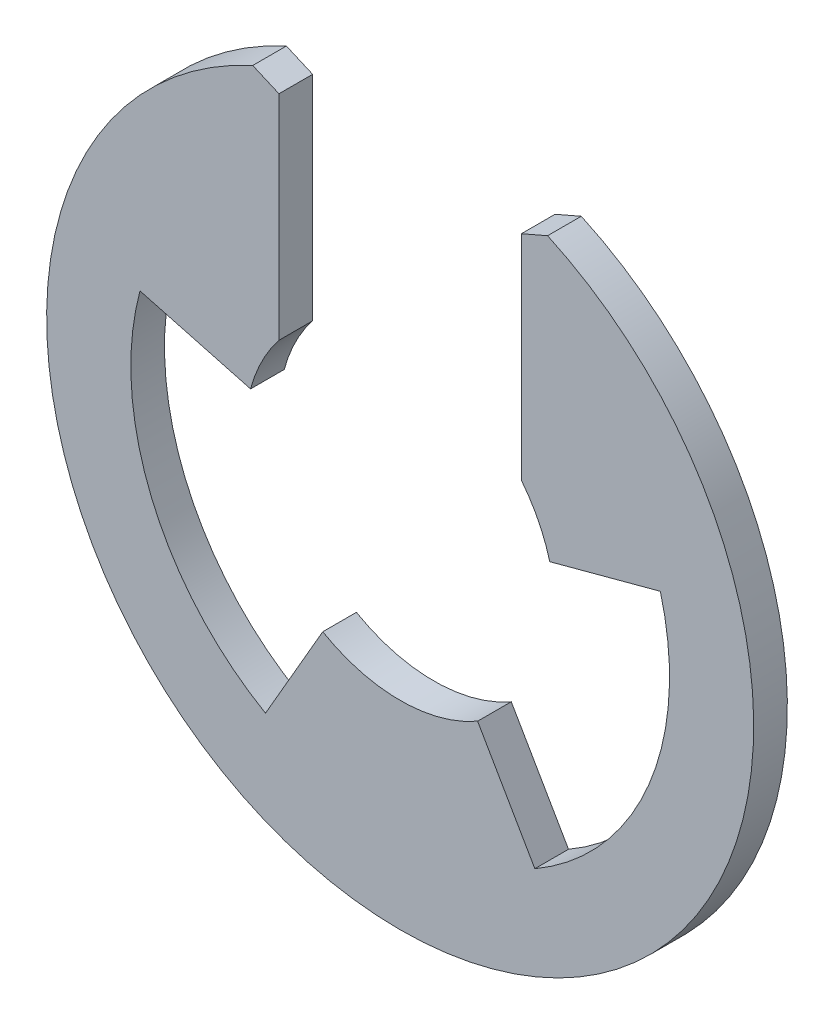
ISO-10303-21;
HEADER;
FILE_DESCRIPTION(('STEP AP214'),'2;1');
FILE_NAME('part.step','',(''),(''),'','','');
FILE_SCHEMA(('AUTOMOTIVE_DESIGN { 1 0 10303 214 1 1 1 1 }'));
ENDSEC;
DATA;
#1=APPLICATION_CONTEXT('core data for automotive mechanical design processes');
#2=APPLICATION_PROTOCOL_DEFINITION('international standard','automotive_design',2000,#1);
#3=PRODUCT_CONTEXT('',#1,'mechanical');
#4=PRODUCT('Part','Part','',(#3));
#5=PRODUCT_RELATED_PRODUCT_CATEGORY('part','',(#4));
#6=PRODUCT_DEFINITION_FORMATION('','',#4);
#7=PRODUCT_DEFINITION_CONTEXT('part definition',#1,'design');
#8=PRODUCT_DEFINITION('design','',#6,#7);
#9=PRODUCT_DEFINITION_SHAPE('','',#8);
#10=(LENGTH_UNIT() NAMED_UNIT(*) SI_UNIT(.MILLI.,.METRE.));
#11=(NAMED_UNIT(*) PLANE_ANGLE_UNIT() SI_UNIT($,.RADIAN.));
#12=(NAMED_UNIT(*) SI_UNIT($,.STERADIAN.) SOLID_ANGLE_UNIT());
#13=UNCERTAINTY_MEASURE_WITH_UNIT(LENGTH_MEASURE(1.E-05),#10,'distance_accuracy_value','');
#14=(GEOMETRIC_REPRESENTATION_CONTEXT(3) GLOBAL_UNCERTAINTY_ASSIGNED_CONTEXT((#13)) GLOBAL_UNIT_ASSIGNED_CONTEXT((#10,
#11,#12)) REPRESENTATION_CONTEXT('',''));
#15=CARTESIAN_POINT('',(0.,0.,0.));
#16=DIRECTION('',(0.,0.,1.));
#17=DIRECTION('',(1.,0.,0.));
#18=AXIS2_PLACEMENT_3D('',#15,#16,#17);
#19=CARTESIAN_POINT('',(0.,0.,0.635));
#20=DIRECTION('',(0.,0.,-1.));
#21=DIRECTION('',(-1.,0.,0.));
#22=AXIS2_PLACEMENT_3D('',#19,#20,#21);
#23=CYLINDRICAL_SURFACE('',#22,2.921);
#24=DIRECTION('',(0.,0.,1.));
#25=VECTOR('',#24,1.);
#26=CARTESIAN_POINT('',(-1.46049999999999,-2.52966020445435,0.));
#27=LINE('',#26,#25);
#28=CARTESIAN_POINT('',(-1.46049999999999,-2.52966020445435,0.));
#29=VERTEX_POINT('',#28);
#30=CARTESIAN_POINT('',(-1.46049999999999,-2.52966020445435,0.635));
#31=VERTEX_POINT('',#30);
#32=EDGE_CURVE('E193',#29,#31,#27,.T.);
#33=ORIENTED_EDGE('',*,*,#32,.T.);
#34=CARTESIAN_POINT('',(0.,0.,0.635));
#35=DIRECTION('',(0.,0.,1.));
#36=DIRECTION('',(1.,0.,0.));
#37=AXIS2_PLACEMENT_3D('',#34,#35,#36);
#38=CIRCLE('',#37,2.921);
#39=CARTESIAN_POINT('',(1.46049999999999,-2.52966020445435,0.635));
#40=VERTEX_POINT('',#39);
#41=EDGE_CURVE('E162',#31,#40,#38,.T.);
#42=ORIENTED_EDGE('',*,*,#41,.T.);
#43=DIRECTION('',(0.,0.,1.));
#44=VECTOR('',#43,1.);
#45=CARTESIAN_POINT('',(1.46049999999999,-2.52966020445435,0.));
#46=LINE('',#45,#44);
#47=CARTESIAN_POINT('',(1.46049999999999,-2.52966020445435,0.));
#48=VERTEX_POINT('',#47);
#49=EDGE_CURVE('E192',#48,#40,#46,.T.);
#50=ORIENTED_EDGE('',*,*,#49,.F.);
#51=CARTESIAN_POINT('',(0.,0.,0.));
#52=DIRECTION('',(0.,0.,1.));
#53=DIRECTION('',(1.,0.,0.));
#54=AXIS2_PLACEMENT_3D('',#51,#52,#53);
#55=CIRCLE('',#54,2.921);
#56=EDGE_CURVE('E159',#29,#48,#55,.T.);
#57=ORIENTED_EDGE('',*,*,#56,.F.);
#58=EDGE_LOOP('',(#33,#42,#50,#57));
#59=FACE_BOUND('',#58,.T.);
#60=ADVANCED_FACE('F33',(#59),#23,.F.);
#61=DIRECTION('',(0.,0.,1.));
#62=VECTOR('',#61,1.);
#63=CARTESIAN_POINT('',(-2.82146933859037,0.756010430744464,0.));
#64=LINE('',#63,#62);
#65=CARTESIAN_POINT('',(-2.82146933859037,0.756010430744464,0.));
#66=VERTEX_POINT('',#65);
#67=CARTESIAN_POINT('',(-2.82146933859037,0.756010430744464,0.635));
#68=VERTEX_POINT('',#67);
#69=EDGE_CURVE('E137',#66,#68,#64,.T.);
#70=ORIENTED_EDGE('',*,*,#69,.F.);
#71=CARTESIAN_POINT('',(-2.286,1.8183632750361,0.));
#72=VERTEX_POINT('',#71);
#73=EDGE_CURVE('E149',#72,#66,#55,.T.);
#74=ORIENTED_EDGE('',*,*,#73,.F.);
#75=DIRECTION('',(0.,0.,1.));
#76=VECTOR('',#75,1.);
#77=CARTESIAN_POINT('',(-2.286,1.8183632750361,0.));
#78=LINE('',#77,#76);
#79=CARTESIAN_POINT('',(-2.286,1.8183632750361,0.635));
#80=VERTEX_POINT('',#79);
#81=EDGE_CURVE('E171',#72,#80,#78,.T.);
#82=ORIENTED_EDGE('',*,*,#81,.T.);
#83=EDGE_CURVE('E151',#80,#68,#38,.T.);
#84=ORIENTED_EDGE('',*,*,#83,.T.);
#85=EDGE_LOOP('',(#70,#74,#82,#84));
#86=FACE_BOUND('',#85,.T.);
#87=ADVANCED_FACE('F147',(#86),#23,.F.);
#88=CARTESIAN_POINT('',(0.,0.,0.635));
#89=DIRECTION('',(0.,0.,1.));
#90=DIRECTION('',(1.,0.,0.));
#91=AXIS2_PLACEMENT_3D('',#88,#89,#90);
#92=PLANE('',#91);
#93=DIRECTION('',(0.499999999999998,0.86602540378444,0.));
#94=VECTOR('',#93,1.);
#95=CARTESIAN_POINT('',(-1.46049999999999,-2.52966020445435,0.635));
#96=LINE('',#95,#94);
#97=CARTESIAN_POINT('',(-2.53999999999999,-4.39940905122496,0.635));
#98=VERTEX_POINT('',#97);
#99=EDGE_CURVE('E142',#98,#31,#96,.T.);
#100=ORIENTED_EDGE('',*,*,#99,.F.);
#101=CARTESIAN_POINT('',(0.,0.,0.635));
#102=DIRECTION('',(0.,0.,1.));
#103=DIRECTION('',(1.,0.,0.));
#104=AXIS2_PLACEMENT_3D('',#101,#102,#103);
#105=CIRCLE('',#104,5.08);
#106=CARTESIAN_POINT('',(-4.90690319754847,1.31480074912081,0.635));
#107=VERTEX_POINT('',#106);
#108=EDGE_CURVE('E260',#107,#98,#105,.T.);
#109=ORIENTED_EDGE('',*,*,#108,.F.);
#110=DIRECTION('',(-0.965925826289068,0.258819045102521,0.));
#111=VECTOR('',#110,1.);
#112=CARTESIAN_POINT('',(-2.82146933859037,0.756010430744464,0.635));
#113=LINE('',#112,#111);
#114=EDGE_CURVE('E258',#68,#107,#113,.T.);
#115=ORIENTED_EDGE('',*,*,#114,.F.);
#116=ORIENTED_EDGE('',*,*,#83,.F.);
#117=DIRECTION('',(0.,-1.,0.));
#118=VECTOR('',#117,1.);
#119=CARTESIAN_POINT('',(-2.286,6.26336652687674,0.635));
#120=LINE('',#119,#118);
#121=CARTESIAN_POINT('',(-2.286,5.84515278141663,0.635));
#122=VERTEX_POINT('',#121);
#123=EDGE_CURVE('E219',#122,#80,#120,.T.);
#124=ORIENTED_EDGE('',*,*,#123,.F.);
#125=DIRECTION('',(-0.917278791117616,0.398245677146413,0.));
#126=VECTOR('',#125,1.);
#127=CARTESIAN_POINT('',(1.77268910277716,4.08303268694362,0.635));
#128=LINE('',#127,#126);
#129=CARTESIAN_POINT('',(-2.78074542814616,6.05995141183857,0.635));
#130=VERTEX_POINT('',#129);
#131=EDGE_CURVE('E240',#122,#130,#128,.T.);
#132=ORIENTED_EDGE('',*,*,#131,.T.);
#133=CARTESIAN_POINT('',(0.,0.,0.635));
#134=DIRECTION('',(0.,0.,1.));
#135=DIRECTION('',(1.,0.,0.));
#136=AXIS2_PLACEMENT_3D('',#133,#134,#135);
#137=CIRCLE('',#136,6.6675);
#138=CARTESIAN_POINT('',(2.78074542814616,6.05995141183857,0.635));
#139=VERTEX_POINT('',#138);
#140=EDGE_CURVE('E184',#130,#139,#137,.T.);
#141=ORIENTED_EDGE('',*,*,#140,.T.);
#142=DIRECTION('',(-0.917278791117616,-0.398245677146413,0.));
#143=VECTOR('',#142,1.);
#144=CARTESIAN_POINT('',(-1.77268910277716,4.08303268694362,0.635));
#145=LINE('',#144,#143);
#146=CARTESIAN_POINT('',(2.286,5.84515278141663,0.635));
#147=VERTEX_POINT('',#146);
#148=EDGE_CURVE('E235',#139,#147,#145,.T.);
#149=ORIENTED_EDGE('',*,*,#148,.T.);
#150=DIRECTION('',(0.,1.,0.));
#151=VECTOR('',#150,1.);
#152=CARTESIAN_POINT('',(2.286,1.8183632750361,0.635));
#153=LINE('',#152,#151);
#154=CARTESIAN_POINT('',(2.286,1.8183632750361,0.635));
#155=VERTEX_POINT('',#154);
#156=EDGE_CURVE('E180',#155,#147,#153,.T.);
#157=ORIENTED_EDGE('',*,*,#156,.F.);
#158=CARTESIAN_POINT('',(2.82146933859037,0.756010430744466,0.635));
#159=VERTEX_POINT('',#158);
#160=EDGE_CURVE('E158',#159,#155,#38,.T.);
#161=ORIENTED_EDGE('',*,*,#160,.F.);
#162=DIRECTION('',(-0.965925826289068,-0.258819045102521,0.));
#163=VECTOR('',#162,1.);
#164=CARTESIAN_POINT('',(4.90690319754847,1.31480074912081,0.635));
#165=LINE('',#164,#163);
#166=CARTESIAN_POINT('',(4.90690319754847,1.31480074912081,0.635));
#167=VERTEX_POINT('',#166);
#168=EDGE_CURVE('E56',#167,#159,#165,.T.);
#169=ORIENTED_EDGE('',*,*,#168,.F.);
#170=CARTESIAN_POINT('',(0.,0.,0.635));
#171=DIRECTION('',(0.,0.,1.));
#172=DIRECTION('',(1.,0.,0.));
#173=AXIS2_PLACEMENT_3D('',#170,#171,#172);
#174=CIRCLE('',#173,5.08);
#175=CARTESIAN_POINT('',(2.53999999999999,-4.39940905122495,0.635));
#176=VERTEX_POINT('',#175);
#177=EDGE_CURVE('E210',#176,#167,#174,.T.);
#178=ORIENTED_EDGE('',*,*,#177,.F.);
#179=DIRECTION('',(0.499999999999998,-0.86602540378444,0.));
#180=VECTOR('',#179,1.);
#181=CARTESIAN_POINT('',(1.46049999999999,-2.52966020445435,0.635));
#182=LINE('',#181,#180);
#183=EDGE_CURVE('E201',#40,#176,#182,.T.);
#184=ORIENTED_EDGE('',*,*,#183,.F.);
#185=ORIENTED_EDGE('',*,*,#41,.F.);
#186=EDGE_LOOP('',(#100,#109,#115,#116,#124,#132,#141,#149,#157,#161,#169,#178,#184,#185));
#187=FACE_BOUND('',#186,.T.);
#188=ADVANCED_FACE('F208',(#187),#92,.T.);
#189=CARTESIAN_POINT('',(0.,0.,0.));
#190=DIRECTION('',(0.,0.,1.));
#191=DIRECTION('',(1.,0.,0.));
#192=AXIS2_PLACEMENT_3D('',#189,#190,#191);
#193=PLANE('',#192);
#194=CARTESIAN_POINT('',(0.,0.,0.));
#195=DIRECTION('',(0.,0.,1.));
#196=DIRECTION('',(1.,0.,0.));
#197=AXIS2_PLACEMENT_3D('',#194,#195,#196);
#198=CIRCLE('',#197,5.08);
#199=CARTESIAN_POINT('',(-4.90690319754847,1.31480074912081,0.));
#200=VERTEX_POINT('',#199);
#201=CARTESIAN_POINT('',(-2.53999999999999,-4.39940905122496,0.));
#202=VERTEX_POINT('',#201);
#203=EDGE_CURVE('E48',#200,#202,#198,.T.);
#204=ORIENTED_EDGE('',*,*,#203,.T.);
#205=DIRECTION('',(0.499999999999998,0.86602540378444,0.));
#206=VECTOR('',#205,1.);
#207=CARTESIAN_POINT('',(-1.46049999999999,-2.52966020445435,0.));
#208=LINE('',#207,#206);
#209=EDGE_CURVE('E152',#202,#29,#208,.T.);
#210=ORIENTED_EDGE('',*,*,#209,.T.);
#211=ORIENTED_EDGE('',*,*,#56,.T.);
#212=DIRECTION('',(0.499999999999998,-0.86602540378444,0.));
#213=VECTOR('',#212,1.);
#214=CARTESIAN_POINT('',(1.46049999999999,-2.52966020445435,0.));
#215=LINE('',#214,#213);
#216=CARTESIAN_POINT('',(2.53999999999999,-4.39940905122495,0.));
#217=VERTEX_POINT('',#216);
#218=EDGE_CURVE('E204',#48,#217,#215,.T.);
#219=ORIENTED_EDGE('',*,*,#218,.T.);
#220=CARTESIAN_POINT('',(0.,0.,0.));
#221=DIRECTION('',(0.,0.,1.));
#222=DIRECTION('',(1.,0.,0.));
#223=AXIS2_PLACEMENT_3D('',#220,#221,#222);
#224=CIRCLE('',#223,5.08);
#225=CARTESIAN_POINT('',(4.90690319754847,1.31480074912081,0.));
#226=VERTEX_POINT('',#225);
#227=EDGE_CURVE('E211',#217,#226,#224,.T.);
#228=ORIENTED_EDGE('',*,*,#227,.T.);
#229=DIRECTION('',(-0.965925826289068,-0.258819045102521,0.));
#230=VECTOR('',#229,1.);
#231=CARTESIAN_POINT('',(4.90690319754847,1.31480074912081,0.));
#232=LINE('',#231,#230);
#233=CARTESIAN_POINT('',(2.82146933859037,0.756010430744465,0.));
#234=VERTEX_POINT('',#233);
#235=EDGE_CURVE('E214',#226,#234,#232,.T.);
#236=ORIENTED_EDGE('',*,*,#235,.T.);
#237=CARTESIAN_POINT('',(2.286,1.8183632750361,0.));
#238=VERTEX_POINT('',#237);
#239=EDGE_CURVE('E161',#234,#238,#55,.T.);
#240=ORIENTED_EDGE('',*,*,#239,.T.);
#241=DIRECTION('',(0.,1.,0.));
#242=VECTOR('',#241,1.);
#243=CARTESIAN_POINT('',(2.286,1.8183632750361,0.));
#244=LINE('',#243,#242);
#245=CARTESIAN_POINT('',(2.286,5.84515278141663,0.));
#246=VERTEX_POINT('',#245);
#247=EDGE_CURVE('E177',#238,#246,#244,.T.);
#248=ORIENTED_EDGE('',*,*,#247,.T.);
#249=DIRECTION('',(0.917278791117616,0.398245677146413,0.));
#250=VECTOR('',#249,1.);
#251=CARTESIAN_POINT('',(2.78074542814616,6.05995141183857,0.));
#252=LINE('',#251,#250);
#253=CARTESIAN_POINT('',(2.78074542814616,6.05995141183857,0.));
#254=VERTEX_POINT('',#253);
#255=EDGE_CURVE('E41',#246,#254,#252,.T.);
#256=ORIENTED_EDGE('',*,*,#255,.T.);
#257=CARTESIAN_POINT('',(0.,0.,0.));
#258=DIRECTION('',(0.,0.,1.));
#259=DIRECTION('',(1.,0.,0.));
#260=AXIS2_PLACEMENT_3D('',#257,#258,#259);
#261=CIRCLE('',#260,6.6675);
#262=CARTESIAN_POINT('',(-2.78074542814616,6.05995141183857,0.));
#263=VERTEX_POINT('',#262);
#264=EDGE_CURVE('E182',#263,#254,#261,.T.);
#265=ORIENTED_EDGE('',*,*,#264,.F.);
#266=DIRECTION('',(0.917278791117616,-0.398245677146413,0.));
#267=VECTOR('',#266,1.);
#268=CARTESIAN_POINT('',(-2.286,5.84515278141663,0.));
#269=LINE('',#268,#267);
#270=CARTESIAN_POINT('',(-2.286,5.84515278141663,0.));
#271=VERTEX_POINT('',#270);
#272=EDGE_CURVE('E237',#263,#271,#269,.T.);
#273=ORIENTED_EDGE('',*,*,#272,.T.);
#274=DIRECTION('',(0.,-1.,0.));
#275=VECTOR('',#274,1.);
#276=CARTESIAN_POINT('',(-2.286,6.26336652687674,0.));
#277=LINE('',#276,#275);
#278=EDGE_CURVE('E156',#271,#72,#277,.T.);
#279=ORIENTED_EDGE('',*,*,#278,.T.);
#280=ORIENTED_EDGE('',*,*,#73,.T.);
#281=DIRECTION('',(-0.965925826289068,0.258819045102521,0.));
#282=VECTOR('',#281,1.);
#283=CARTESIAN_POINT('',(-2.82146933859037,0.756010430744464,0.));
#284=LINE('',#283,#282);
#285=EDGE_CURVE('E133',#66,#200,#284,.T.);
#286=ORIENTED_EDGE('',*,*,#285,.T.);
#287=EDGE_LOOP('',(#204,#210,#211,#219,#228,#236,#240,#248,#256,#265,#273,#279,#280,#286));
#288=FACE_BOUND('',#287,.T.);
#289=ADVANCED_FACE('F154',(#288),#193,.F.);
#290=CARTESIAN_POINT('',(0.,0.,0.635));
#291=DIRECTION('',(0.,0.,-1.));
#292=DIRECTION('',(-1.,0.,0.));
#293=AXIS2_PLACEMENT_3D('',#290,#291,#292);
#294=CYLINDRICAL_SURFACE('',#293,6.6675);
#295=ORIENTED_EDGE('',*,*,#264,.T.);
#296=DIRECTION('',(0.,0.,-1.));
#297=VECTOR('',#296,1.);
#298=CARTESIAN_POINT('',(2.78074542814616,6.05995141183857,0.635));
#299=LINE('',#298,#297);
#300=EDGE_CURVE('E248',#254,#139,#299,.F.);
#301=ORIENTED_EDGE('',*,*,#300,.T.);
#302=ORIENTED_EDGE('',*,*,#140,.F.);
#303=DIRECTION('',(0.,0.,-1.));
#304=VECTOR('',#303,1.);
#305=CARTESIAN_POINT('',(-2.78074542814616,6.05995141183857,0.635));
#306=LINE('',#305,#304);
#307=EDGE_CURVE('E251',#130,#263,#306,.T.);
#308=ORIENTED_EDGE('',*,*,#307,.T.);
#309=EDGE_LOOP('',(#295,#301,#302,#308));
#310=FACE_BOUND('',#309,.T.);
#311=ADVANCED_FACE('F246',(#310),#294,.T.);
#312=DIRECTION('',(0.,0.,1.));
#313=VECTOR('',#312,1.);
#314=CARTESIAN_POINT('',(2.82146933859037,0.756010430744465,0.));
#315=LINE('',#314,#313);
#316=EDGE_CURVE('E206',#234,#159,#315,.T.);
#317=ORIENTED_EDGE('',*,*,#316,.T.);
#318=ORIENTED_EDGE('',*,*,#160,.T.);
#319=DIRECTION('',(0.,0.,1.));
#320=VECTOR('',#319,1.);
#321=CARTESIAN_POINT('',(2.286,1.8183632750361,0.));
#322=LINE('',#321,#320);
#323=EDGE_CURVE('E165',#238,#155,#322,.T.);
#324=ORIENTED_EDGE('',*,*,#323,.F.);
#325=ORIENTED_EDGE('',*,*,#239,.F.);
#326=EDGE_LOOP('',(#317,#318,#324,#325));
#327=FACE_BOUND('',#326,.T.);
#328=ADVANCED_FACE('F277',(#327),#23,.F.);
#329=CARTESIAN_POINT('',(-2.286,6.26336652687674,0.));
#330=DIRECTION('',(-1.,0.,0.));
#331=DIRECTION('',(0.,-1.,0.));
#332=AXIS2_PLACEMENT_3D('',#329,#330,#331);
#333=PLANE('',#332);
#334=ORIENTED_EDGE('',*,*,#278,.F.);
#335=DIRECTION('',(0.,0.,1.));
#336=VECTOR('',#335,1.);
#337=CARTESIAN_POINT('',(-2.286,5.84515278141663,0.));
#338=LINE('',#337,#336);
#339=EDGE_CURVE('E11',#271,#122,#338,.T.);
#340=ORIENTED_EDGE('',*,*,#339,.T.);
#341=ORIENTED_EDGE('',*,*,#123,.T.);
#342=ORIENTED_EDGE('',*,*,#81,.F.);
#343=EDGE_LOOP('',(#334,#340,#341,#342));
#344=FACE_BOUND('',#343,.T.);
#345=ADVANCED_FACE('F256',(#344),#333,.F.);
#346=CARTESIAN_POINT('',(2.286,1.8183632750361,0.));
#347=DIRECTION('',(1.,0.,0.));
#348=DIRECTION('',(0.,0.,-1.));
#349=AXIS2_PLACEMENT_3D('',#346,#347,#348);
#350=PLANE('',#349);
#351=ORIENTED_EDGE('',*,*,#156,.T.);
#352=DIRECTION('',(0.,0.,-1.));
#353=VECTOR('',#352,1.);
#354=CARTESIAN_POINT('',(2.286,5.84515278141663,0.));
#355=LINE('',#354,#353);
#356=EDGE_CURVE('E229',#147,#246,#355,.T.);
#357=ORIENTED_EDGE('',*,*,#356,.T.);
#358=ORIENTED_EDGE('',*,*,#247,.F.);
#359=ORIENTED_EDGE('',*,*,#323,.T.);
#360=EDGE_LOOP('',(#351,#357,#358,#359));
#361=FACE_BOUND('',#360,.T.);
#362=ADVANCED_FACE('F228',(#361),#350,.F.);
#363=CARTESIAN_POINT('',(2.78074542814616,6.05995141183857,0.635));
#364=DIRECTION('',(-0.398245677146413,0.917278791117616,0.));
#365=DIRECTION('',(-0.917278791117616,-0.398245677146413,0.));
#366=AXIS2_PLACEMENT_3D('',#363,#364,#365);
#367=PLANE('',#366);
#368=ORIENTED_EDGE('',*,*,#255,.F.);
#369=ORIENTED_EDGE('',*,*,#356,.F.);
#370=ORIENTED_EDGE('',*,*,#148,.F.);
#371=ORIENTED_EDGE('',*,*,#300,.F.);
#372=EDGE_LOOP('',(#368,#369,#370,#371));
#373=FACE_BOUND('',#372,.T.);
#374=ADVANCED_FACE('F233',(#373),#367,.T.);
#375=CARTESIAN_POINT('',(-2.286,5.84515278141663,0.635));
#376=DIRECTION('',(0.398245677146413,0.917278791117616,0.));
#377=DIRECTION('',(-0.917278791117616,0.398245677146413,0.));
#378=AXIS2_PLACEMENT_3D('',#375,#376,#377);
#379=PLANE('',#378);
#380=ORIENTED_EDGE('',*,*,#272,.F.);
#381=ORIENTED_EDGE('',*,*,#307,.F.);
#382=ORIENTED_EDGE('',*,*,#131,.F.);
#383=ORIENTED_EDGE('',*,*,#339,.F.);
#384=EDGE_LOOP('',(#380,#381,#382,#383));
#385=FACE_BOUND('',#384,.T.);
#386=ADVANCED_FACE('F35',(#385),#379,.T.);
#387=CARTESIAN_POINT('',(0.,0.,0.));
#388=DIRECTION('',(0.,0.,1.));
#389=DIRECTION('',(1.,0.,0.));
#390=AXIS2_PLACEMENT_3D('',#387,#388,#389);
#391=CYLINDRICAL_SURFACE('',#390,5.08);
#392=ORIENTED_EDGE('',*,*,#177,.T.);
#393=DIRECTION('',(0.,0.,1.));
#394=VECTOR('',#393,1.);
#395=CARTESIAN_POINT('',(4.90690319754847,1.31480074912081,0.));
#396=LINE('',#395,#394);
#397=EDGE_CURVE('E222',#226,#167,#396,.T.);
#398=ORIENTED_EDGE('',*,*,#397,.F.);
#399=ORIENTED_EDGE('',*,*,#227,.F.);
#400=DIRECTION('',(0.,0.,1.));
#401=VECTOR('',#400,1.);
#402=CARTESIAN_POINT('',(2.53999999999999,-4.39940905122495,0.));
#403=LINE('',#402,#401);
#404=EDGE_CURVE('E205',#217,#176,#403,.T.);
#405=ORIENTED_EDGE('',*,*,#404,.T.);
#406=EDGE_LOOP('',(#392,#398,#399,#405));
#407=FACE_BOUND('',#406,.T.);
#408=ADVANCED_FACE('F273',(#407),#391,.F.);
#409=CARTESIAN_POINT('',(1.46049999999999,-2.52966020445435,0.));
#410=DIRECTION('',(-0.86602540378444,-0.499999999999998,0.));
#411=DIRECTION('',(0.499999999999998,-0.86602540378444,0.));
#412=AXIS2_PLACEMENT_3D('',#409,#410,#411);
#413=PLANE('',#412);
#414=ORIENTED_EDGE('',*,*,#183,.T.);
#415=ORIENTED_EDGE('',*,*,#404,.F.);
#416=ORIENTED_EDGE('',*,*,#218,.F.);
#417=ORIENTED_EDGE('',*,*,#49,.T.);
#418=EDGE_LOOP('',(#414,#415,#416,#417));
#419=FACE_BOUND('',#418,.T.);
#420=ADVANCED_FACE('F200',(#419),#413,.F.);
#421=CARTESIAN_POINT('',(4.90690319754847,1.31480074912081,0.));
#422=DIRECTION('',(-0.258819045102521,0.965925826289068,0.));
#423=DIRECTION('',(-0.965925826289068,-0.258819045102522,0.));
#424=AXIS2_PLACEMENT_3D('',#421,#422,#423);
#425=PLANE('',#424);
#426=ORIENTED_EDGE('',*,*,#168,.T.);
#427=ORIENTED_EDGE('',*,*,#316,.F.);
#428=ORIENTED_EDGE('',*,*,#235,.F.);
#429=ORIENTED_EDGE('',*,*,#397,.T.);
#430=EDGE_LOOP('',(#426,#427,#428,#429));
#431=FACE_BOUND('',#430,.T.);
#432=ADVANCED_FACE('F278',(#431),#425,.F.);
#433=CARTESIAN_POINT('',(-1.46049999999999,-2.52966020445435,0.));
#434=DIRECTION('',(0.86602540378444,-0.499999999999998,0.));
#435=DIRECTION('',(0.499999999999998,0.86602540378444,0.));
#436=AXIS2_PLACEMENT_3D('',#433,#434,#435);
#437=PLANE('',#436);
#438=ORIENTED_EDGE('',*,*,#99,.T.);
#439=ORIENTED_EDGE('',*,*,#32,.F.);
#440=ORIENTED_EDGE('',*,*,#209,.F.);
#441=DIRECTION('',(0.,0.,1.));
#442=VECTOR('',#441,1.);
#443=CARTESIAN_POINT('',(-2.53999999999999,-4.39940905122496,0.));
#444=LINE('',#443,#442);
#445=EDGE_CURVE('E268',#202,#98,#444,.T.);
#446=ORIENTED_EDGE('',*,*,#445,.T.);
#447=EDGE_LOOP('',(#438,#439,#440,#446));
#448=FACE_BOUND('',#447,.T.);
#449=ADVANCED_FACE('F282',(#448),#437,.F.);
#450=CARTESIAN_POINT('',(0.,0.,0.));
#451=DIRECTION('',(0.,0.,1.));
#452=DIRECTION('',(1.,0.,0.));
#453=AXIS2_PLACEMENT_3D('',#450,#451,#452);
#454=CYLINDRICAL_SURFACE('',#453,5.08);
#455=ORIENTED_EDGE('',*,*,#108,.T.);
#456=ORIENTED_EDGE('',*,*,#445,.F.);
#457=ORIENTED_EDGE('',*,*,#203,.F.);
#458=DIRECTION('',(0.,0.,1.));
#459=VECTOR('',#458,1.);
#460=CARTESIAN_POINT('',(-4.90690319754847,1.31480074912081,0.));
#461=LINE('',#460,#459);
#462=EDGE_CURVE('E139',#200,#107,#461,.T.);
#463=ORIENTED_EDGE('',*,*,#462,.T.);
#464=EDGE_LOOP('',(#455,#456,#457,#463));
#465=FACE_BOUND('',#464,.T.);
#466=ADVANCED_FACE('F283',(#465),#454,.F.);
#467=CARTESIAN_POINT('',(-2.82146933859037,0.756010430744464,0.));
#468=DIRECTION('',(0.258819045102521,0.965925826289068,0.));
#469=DIRECTION('',(-0.965925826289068,0.258819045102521,0.));
#470=AXIS2_PLACEMENT_3D('',#467,#468,#469);
#471=PLANE('',#470);
#472=ORIENTED_EDGE('',*,*,#114,.T.);
#473=ORIENTED_EDGE('',*,*,#462,.F.);
#474=ORIENTED_EDGE('',*,*,#285,.F.);
#475=ORIENTED_EDGE('',*,*,#69,.T.);
#476=EDGE_LOOP('',(#472,#473,#474,#475));
#477=FACE_BOUND('',#476,.T.);
#478=ADVANCED_FACE('F136',(#477),#471,.F.);
#479=CLOSED_SHELL('',(#60,#87,#188,#289,#311,#328,#345,#362,#374,#386,#408,#420,#432,#449,#466,#478));
#480=MANIFOLD_SOLID_BREP('B2',#479);
#481=ADVANCED_BREP_SHAPE_REPRESENTATION('',(#18,#480),#14);
#482=SHAPE_DEFINITION_REPRESENTATION(#9,#481);
ENDSEC;
END-ISO-10303-21;
